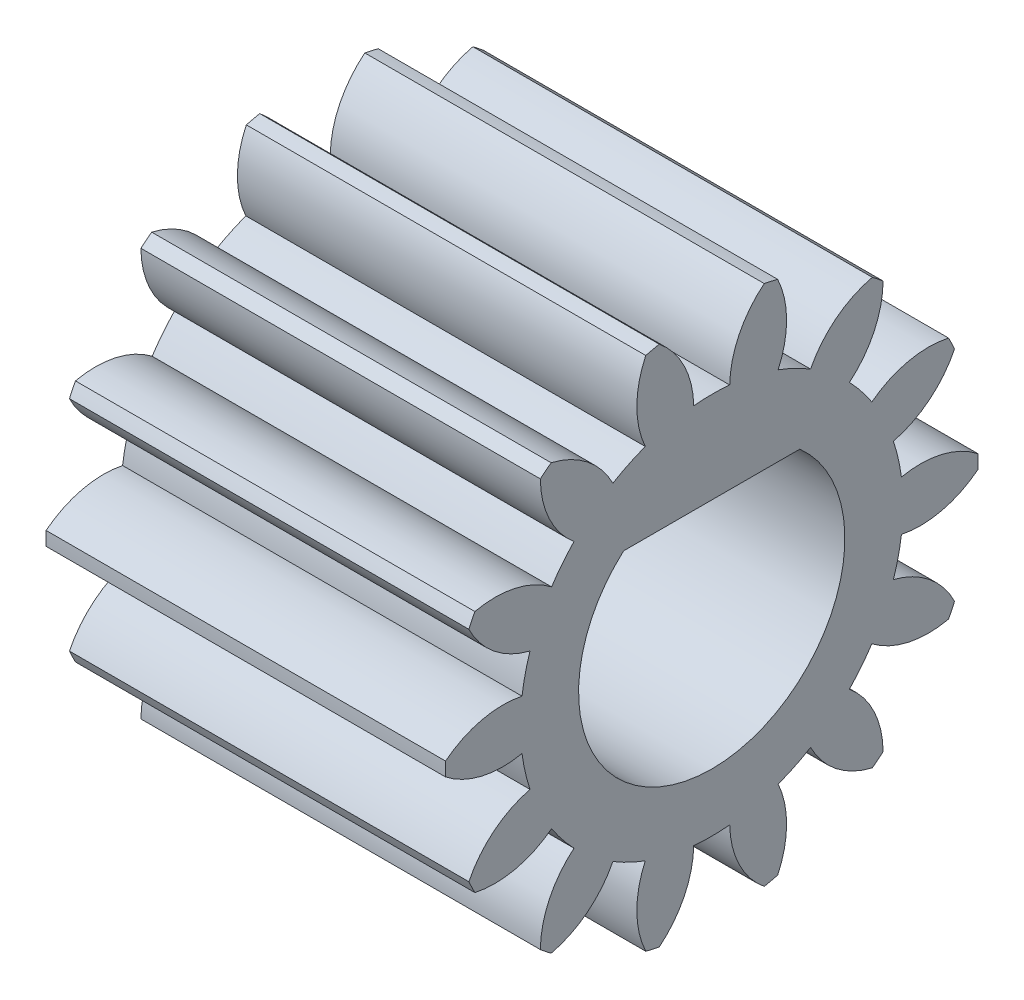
from build123d import *

# Parameters (mm, degrees)
BASPROSKE_W     = 6
BASPROSKE_H     = 4
TOOTHCUT_DEPTH  = 9.246211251
TEETHCUTS_COUNT = 14
BORE_DEPTH      = 50.0000508


with BuildPart() as part:
    # BasProSke → Base-Revolve (revolve)
    with BuildSketch(Plane(origin=(0, 0, 0), x_dir=(1, 0, 0), z_dir=(0, 1, 0)), mode=Mode.PRIVATE) as base_revolve_sk:
        with Locations((3, 2)):
            Rectangle(BASPROSKE_W, BASPROSKE_H)
    revolve(base_revolve_sk.sketch.rotate(Axis((-10, 0, 0), (1, 0, 0)), 180), axis=Axis((-10, 0, 0), (1, 0, 0)))

    # TooCutSke → ToothCut (cut, through all)
    with BuildSketch(Plane(origin=(0, 0, 0), x_dir=(0, 0, -1), z_dir=(1, 0, 0))):
        with BuildLine():
            ThreePointArc((0.270186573, 2.861271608), (0, 2.874), (-0.270186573, 2.861271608))
            ThreePointArc((-0.270186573, 2.861271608), (-0.419730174, 3.4635664), (-0.814922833, 3.942048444))
            ThreePointArc((-0.814922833, 3.942048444), (0, 4.0254), (0.814922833, 3.942048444))
            ThreePointArc((0.814922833, 3.942048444), (0.419730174, 3.4635664), (0.270186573, 2.861271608))
        make_face()
    toothcut = extrude(amount=TOOTHCUT_DEPTH, mode=Mode.SUBTRACT)

    # TeethCuts: ToothCut ×14 about axis
    teethcuts_axis = Axis((0, 0, 0), (1, 0, 0))
    for i in range(1, TEETHCUTS_COUNT):
        add(toothcut.rotate(teethcuts_axis, i * 360 / TEETHCUTS_COUNT), mode=Mode.SUBTRACT)

    # BorSke → Bore (cut, symmetric)
    with BuildSketch(Plane(origin=(0, 0, 0), x_dir=(0, 0, -1), z_dir=(1, 0, 0))):
        with BuildLine():
            Line((-1.322875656, 1.5), (1.322875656, 1.5))
            ThreePointArc((1.322875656, 1.5), (0, -2), (-1.322875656, 1.5))
        make_face()
    extrude(amount=BORE_DEPTH, both=True, mode=Mode.SUBTRACT)


solid = part.part
